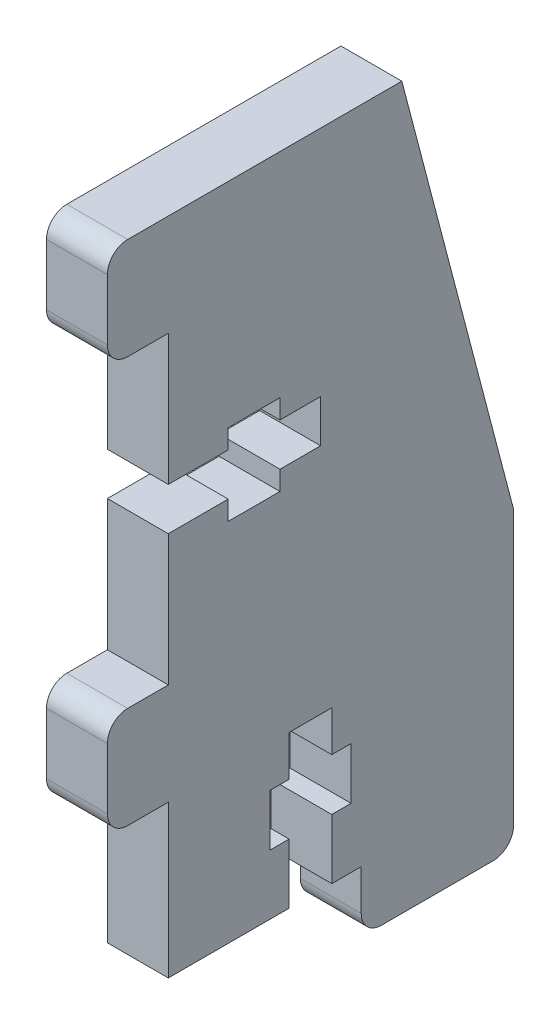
from build123d import *

# Parameters (mm, degrees)
EXTRUDE_1_DEPTH     = 6
SKETCH_2_W          = 4.2
SKETCH_2_H          = 4
SKETCH_2_W_2        = 1.9
SKETCH_2_H_2        = 5.1
SKETCH_2_H_3        = 5.9
CUT_EXTRUDE_1_DEPTH = 74.600271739
EXTRUDE_2_DEPTH     = 6


with BuildPart() as part:
    # Sketch 1 → Extrude 1 (new body)
    with BuildSketch(Plane(origin=(0, 0, 0), x_dir=(0, 0, -1), z_dir=(1, 0, 0))):
        with BuildLine():
            Line((0, 55), (0, 65))
            Line((0, 65), (-4, 65))
            ThreePointArc((-4, 65), (-5.414213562, 64.414213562), (-6, 63))
            Line((-6, 63), (-6, 57))
            ThreePointArc((-6, 57), (-5.414213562, 55.585786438), (-4, 55))
            Line((-4, 55), (0, 55))
        make_face()
        with BuildLine():
            Line((-4, 15), (0, 15))
            Line((0, 15), (0, 25))
            Line((0, 25), (-4, 25))
            ThreePointArc((-4, 25), (-5.414213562, 24.414213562), (-6, 23))
            Line((-6, 23), (-6, 17))
            ThreePointArc((-6, 17), (-5.414213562, 15.585786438), (-4, 15))
        make_face()
        Polygon((34, 23), (23, 65), (0, 65), (0, 55), (0, 42.1), (5.9, 42.1), (5.9, 44), (11, 44), (11, 42.1), (15, 42.1), (15, 37.9), (11, 37.9), (11, 36), (5.9, 36), (5.9, 37.9), (0, 37.9), (0, 25), (0, 15), (0, 0), (34, 0), align=None)
    extrude(amount=EXTRUDE_1_DEPTH)

    # Sketch 2 → Cut-Extrude 1 (cut, through all)
    with BuildSketch(Plane(origin=(6, 0, 0), x_dir=(0, 0, -1), z_dir=(1, 0, 0))):
        with Locations((14, 13)):
            Rectangle(SKETCH_2_W, SKETCH_2_H)
        with Locations((10.95, 8.45)):
            Rectangle(SKETCH_2_W_2, SKETCH_2_H_2)
        with Locations((17.05, 8.45)):
            Rectangle(SKETCH_2_W_2, SKETCH_2_H_2)
        with Locations((14, 8.45)):
            Rectangle(SKETCH_2_W, SKETCH_2_H_2)
        with Locations((14, 2.95)):
            Rectangle(SKETCH_2_W, SKETCH_2_H_3)
    extrude(amount=-CUT_EXTRUDE_1_DEPTH, mode=Mode.SUBTRACT)

    # Sketch 3 → Extrude 2 (add)
    with BuildSketch(Plane(origin=(6, 0, 0), x_dir=(0, 0, -1), z_dir=(1, 0, 0))):
        with BuildLine():
            Line((34, 0), (19, 0))
            Line((19, 0), (19, -4))
            ThreePointArc((19, -4), (19.585786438, -5.414213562), (21, -6))
            Line((21, -6), (32, -6))
            ThreePointArc((32, -6), (33.414213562, -5.414213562), (34, -4))
            Line((34, -4), (34, 0))
        make_face()
    extrude(amount=-EXTRUDE_2_DEPTH)


solid = part.part
